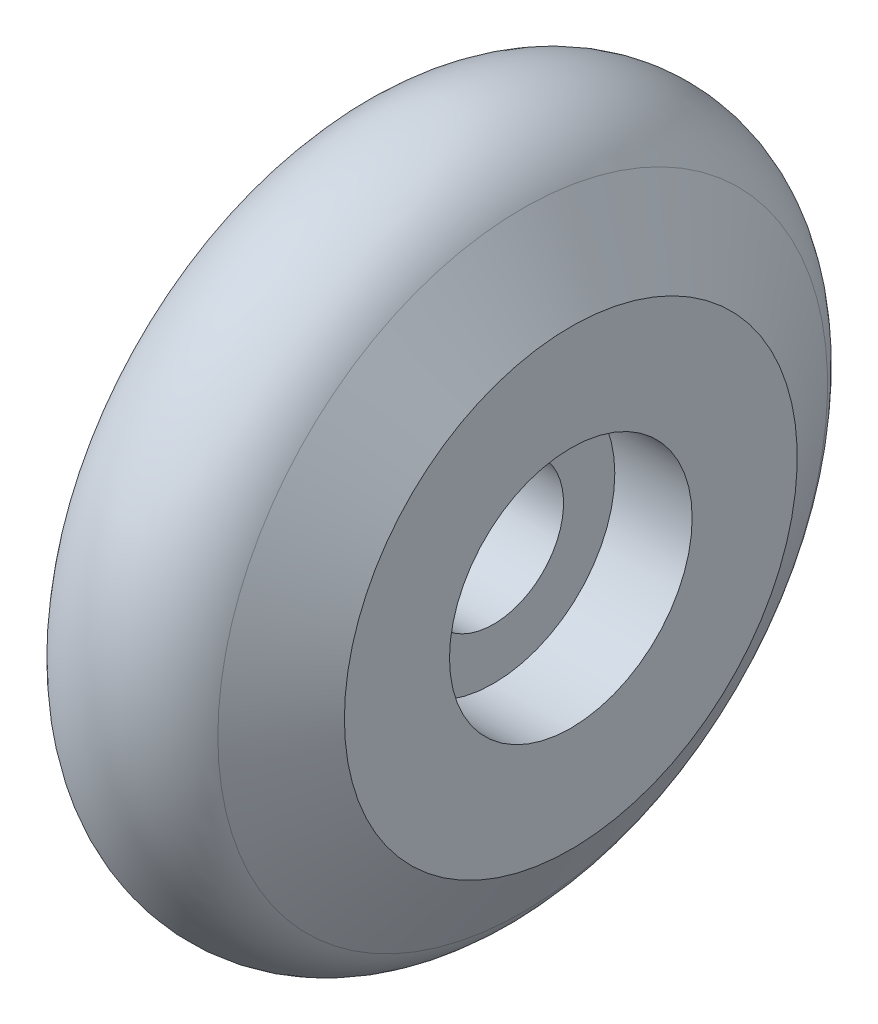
ISO-10303-21;
HEADER;
FILE_DESCRIPTION(('STEP AP214'),'2;1');
FILE_NAME('part.step','',(''),(''),'','','');
FILE_SCHEMA(('AUTOMOTIVE_DESIGN { 1 0 10303 214 1 1 1 1 }'));
ENDSEC;
DATA;
#1=APPLICATION_CONTEXT('core data for automotive mechanical design processes');
#2=APPLICATION_PROTOCOL_DEFINITION('international standard','automotive_design',2000,#1);
#3=PRODUCT_CONTEXT('',#1,'mechanical');
#4=PRODUCT('Part','Part','',(#3));
#5=PRODUCT_RELATED_PRODUCT_CATEGORY('part','',(#4));
#6=PRODUCT_DEFINITION_FORMATION('','',#4);
#7=PRODUCT_DEFINITION_CONTEXT('part definition',#1,'design');
#8=PRODUCT_DEFINITION('design','',#6,#7);
#9=PRODUCT_DEFINITION_SHAPE('','',#8);
#10=(LENGTH_UNIT() NAMED_UNIT(*) SI_UNIT(.MILLI.,.METRE.));
#11=(NAMED_UNIT(*) PLANE_ANGLE_UNIT() SI_UNIT($,.RADIAN.));
#12=(NAMED_UNIT(*) SI_UNIT($,.STERADIAN.) SOLID_ANGLE_UNIT());
#13=UNCERTAINTY_MEASURE_WITH_UNIT(LENGTH_MEASURE(1.E-05),#10,'distance_accuracy_value','');
#14=(GEOMETRIC_REPRESENTATION_CONTEXT(3) GLOBAL_UNCERTAINTY_ASSIGNED_CONTEXT((#13)) GLOBAL_UNIT_ASSIGNED_CONTEXT((#10,
#11,#12)) REPRESENTATION_CONTEXT('',''));
#15=CARTESIAN_POINT('',(0.,0.,0.));
#16=DIRECTION('',(0.,0.,1.));
#17=DIRECTION('',(1.,0.,0.));
#18=AXIS2_PLACEMENT_3D('',#15,#16,#17);
#19=CARTESIAN_POINT('',(-4.9276,10.9982,0.));
#20=DIRECTION('',(1.,0.,0.));
#21=DIRECTION('',(0.,0.,-1.));
#22=AXIS2_PLACEMENT_3D('',#19,#20,#21);
#23=PLANE('',#22);
#24=CARTESIAN_POINT('',(-4.9276,0.,0.));
#25=DIRECTION('',(-1.,0.,0.));
#26=DIRECTION('',(0.,0.,1.));
#27=AXIS2_PLACEMENT_3D('',#24,#25,#26);
#28=CIRCLE('',#27,6.35);
#29=CARTESIAN_POINT('',(-4.9276,0.,6.35));
#30=VERTEX_POINT('',#29);
#31=EDGE_CURVE('E10',#30,#30,#28,.T.);
#32=ORIENTED_EDGE('',*,*,#31,.F.);
#33=EDGE_LOOP('',(#32));
#34=FACE_BOUND('',#33,.T.);
#35=CARTESIAN_POINT('',(-4.9276,0.,0.));
#36=DIRECTION('',(-1.,0.,0.));
#37=DIRECTION('',(0.,0.,1.));
#38=AXIS2_PLACEMENT_3D('',#35,#36,#37);
#39=CIRCLE('',#38,10.9982);
#40=CARTESIAN_POINT('',(-4.9276,0.,10.9982));
#41=VERTEX_POINT('',#40);
#42=EDGE_CURVE('E64',#41,#41,#39,.T.);
#43=ORIENTED_EDGE('',*,*,#42,.T.);
#44=EDGE_LOOP('',(#43));
#45=FACE_BOUND('',#44,.T.);
#46=ADVANCED_FACE('F30',(#34,#45),#23,.F.);
#47=CARTESIAN_POINT('',(0.,0.,0.));
#48=DIRECTION('',(-1.,0.,0.));
#49=DIRECTION('',(0.,0.,1.));
#50=AXIS2_PLACEMENT_3D('',#47,#48,#49);
#51=CYLINDRICAL_SURFACE('',#50,6.35);
#52=CARTESIAN_POINT('',(4.9276,0.,0.));
#53=DIRECTION('',(-1.,0.,0.));
#54=DIRECTION('',(0.,0.,1.));
#55=AXIS2_PLACEMENT_3D('',#52,#53,#54);
#56=CIRCLE('',#55,6.35);
#57=CARTESIAN_POINT('',(4.9276,0.,6.35));
#58=VERTEX_POINT('',#57);
#59=EDGE_CURVE('E36',#58,#58,#56,.T.);
#60=ORIENTED_EDGE('',*,*,#59,.F.);
#61=EDGE_LOOP('',(#60));
#62=FACE_BOUND('',#61,.T.);
#63=ORIENTED_EDGE('',*,*,#31,.T.);
#64=EDGE_LOOP('',(#63));
#65=FACE_BOUND('',#64,.T.);
#66=ADVANCED_FACE('F113',(#62,#65),#51,.F.);
#67=CARTESIAN_POINT('',(4.9276,6.35,0.));
#68=DIRECTION('',(-1.,0.,0.));
#69=DIRECTION('',(0.,0.,1.));
#70=AXIS2_PLACEMENT_3D('',#67,#68,#69);
#71=PLANE('',#70);
#72=CARTESIAN_POINT('',(4.9276,0.,0.));
#73=DIRECTION('',(-1.,0.,0.));
#74=DIRECTION('',(0.,0.,1.));
#75=AXIS2_PLACEMENT_3D('',#72,#73,#74);
#76=CIRCLE('',#75,10.9982);
#77=CARTESIAN_POINT('',(4.9276,0.,10.9982));
#78=VERTEX_POINT('',#77);
#79=EDGE_CURVE('E40',#78,#78,#76,.T.);
#80=ORIENTED_EDGE('',*,*,#79,.F.);
#81=EDGE_LOOP('',(#80));
#82=FACE_BOUND('',#81,.T.);
#83=ORIENTED_EDGE('',*,*,#59,.T.);
#84=EDGE_LOOP('',(#83));
#85=FACE_BOUND('',#84,.T.);
#86=ADVANCED_FACE('F108',(#82,#85),#71,.F.);
#87=CARTESIAN_POINT('',(0.,0.,0.));
#88=DIRECTION('',(-1.,0.,0.));
#89=DIRECTION('',(0.,0.,1.));
#90=AXIS2_PLACEMENT_3D('',#87,#88,#89);
#91=CYLINDRICAL_SURFACE('',#90,10.9982);
#92=CARTESIAN_POINT('',(11.938,0.,0.));
#93=DIRECTION('',(-1.,0.,0.));
#94=DIRECTION('',(0.,0.,1.));
#95=AXIS2_PLACEMENT_3D('',#92,#93,#94);
#96=CIRCLE('',#95,10.9982);
#97=CARTESIAN_POINT('',(11.938,0.,10.9982));
#98=VERTEX_POINT('',#97);
#99=EDGE_CURVE('E44',#98,#98,#96,.T.);
#100=ORIENTED_EDGE('',*,*,#99,.F.);
#101=EDGE_LOOP('',(#100));
#102=FACE_BOUND('',#101,.T.);
#103=ORIENTED_EDGE('',*,*,#79,.T.);
#104=EDGE_LOOP('',(#103));
#105=FACE_BOUND('',#104,.T.);
#106=ADVANCED_FACE('F102',(#102,#105),#91,.F.);
#107=CARTESIAN_POINT('',(11.938,10.9982,0.));
#108=DIRECTION('',(-1.,0.,0.));
#109=DIRECTION('',(0.,0.,1.));
#110=AXIS2_PLACEMENT_3D('',#107,#108,#109);
#111=PLANE('',#110);
#112=CARTESIAN_POINT('',(11.938,0.,0.));
#113=DIRECTION('',(-1.,0.,0.));
#114=DIRECTION('',(0.,0.,1.));
#115=AXIS2_PLACEMENT_3D('',#112,#113,#114);
#116=CIRCLE('',#115,20.5232);
#117=CARTESIAN_POINT('',(11.938,0.,20.5232));
#118=VERTEX_POINT('',#117);
#119=EDGE_CURVE('E49',#118,#118,#116,.T.);
#120=ORIENTED_EDGE('',*,*,#119,.F.);
#121=EDGE_LOOP('',(#120));
#122=FACE_BOUND('',#121,.T.);
#123=ORIENTED_EDGE('',*,*,#99,.T.);
#124=EDGE_LOOP('',(#123));
#125=FACE_BOUND('',#124,.T.);
#126=ADVANCED_FACE('F96',(#122,#125),#111,.F.);
#127=CARTESIAN_POINT('',(11.938,0.,0.));
#128=DIRECTION('',(-1.,0.,0.));
#129=DIRECTION('',(0.,0.,1.));
#130=AXIS2_PLACEMENT_3D('',#127,#128,#129);
#131=CONICAL_SURFACE('',#130,20.5232,1.02083937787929);
#132=CARTESIAN_POINT('',(7.57914303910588,0.,0.));
#133=DIRECTION('',(-1.,0.,0.));
#134=DIRECTION('',(0.,0.,1.));
#135=AXIS2_PLACEMENT_3D('',#132,#133,#134);
#136=CIRCLE('',#135,27.6333631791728);
#137=CARTESIAN_POINT('',(7.57914303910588,0.,27.6333631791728));
#138=VERTEX_POINT('',#137);
#139=EDGE_CURVE('E52',#138,#138,#136,.T.);
#140=ORIENTED_EDGE('',*,*,#139,.F.);
#141=EDGE_LOOP('',(#140));
#142=FACE_BOUND('',#141,.T.);
#143=ORIENTED_EDGE('',*,*,#119,.T.);
#144=EDGE_LOOP('',(#143));
#145=FACE_BOUND('',#144,.T.);
#146=ADVANCED_FACE('F90',(#142,#145),#131,.T.);
#147=CARTESIAN_POINT('',(0.,0.,0.));
#148=DIRECTION('',(-1.,0.,0.));
#149=DIRECTION('',(0.,0.,1.));
#150=AXIS2_PLACEMENT_3D('',#147,#148,#149);
#151=TOROIDAL_SURFACE('',#150,22.987,8.89);
#152=CARTESIAN_POINT('',(-7.57914303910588,0.,0.));
#153=DIRECTION('',(-1.,0.,0.));
#154=DIRECTION('',(0.,0.,1.));
#155=AXIS2_PLACEMENT_3D('',#152,#153,#154);
#156=CIRCLE('',#155,27.6333631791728);
#157=CARTESIAN_POINT('',(-7.57914303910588,0.,27.6333631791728));
#158=VERTEX_POINT('',#157);
#159=EDGE_CURVE('E55',#158,#158,#156,.T.);
#160=ORIENTED_EDGE('',*,*,#159,.F.);
#161=EDGE_LOOP('',(#160));
#162=FACE_BOUND('',#161,.T.);
#163=ORIENTED_EDGE('',*,*,#139,.T.);
#164=EDGE_LOOP('',(#163));
#165=FACE_BOUND('',#164,.T.);
#166=ADVANCED_FACE('F84',(#162,#165),#151,.T.);
#167=CARTESIAN_POINT('',(-7.57914303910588,0.,0.));
#168=DIRECTION('',(1.,0.,0.));
#169=DIRECTION('',(0.,0.,-1.));
#170=AXIS2_PLACEMENT_3D('',#167,#168,#169);
#171=CONICAL_SURFACE('',#170,27.6333631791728,1.02083937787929);
#172=CARTESIAN_POINT('',(-11.938,0.,0.));
#173=DIRECTION('',(-1.,0.,0.));
#174=DIRECTION('',(0.,0.,1.));
#175=AXIS2_PLACEMENT_3D('',#172,#173,#174);
#176=CIRCLE('',#175,20.5232);
#177=CARTESIAN_POINT('',(-11.938,0.,20.5232));
#178=VERTEX_POINT('',#177);
#179=EDGE_CURVE('E58',#178,#178,#176,.T.);
#180=ORIENTED_EDGE('',*,*,#179,.F.);
#181=EDGE_LOOP('',(#180));
#182=FACE_BOUND('',#181,.T.);
#183=ORIENTED_EDGE('',*,*,#159,.T.);
#184=EDGE_LOOP('',(#183));
#185=FACE_BOUND('',#184,.T.);
#186=ADVANCED_FACE('F78',(#182,#185),#171,.T.);
#187=CARTESIAN_POINT('',(-11.938,20.5232,0.));
#188=DIRECTION('',(1.,0.,0.));
#189=DIRECTION('',(0.,0.,-1.));
#190=AXIS2_PLACEMENT_3D('',#187,#188,#189);
#191=PLANE('',#190);
#192=CARTESIAN_POINT('',(-11.938,0.,0.));
#193=DIRECTION('',(-1.,0.,0.));
#194=DIRECTION('',(0.,0.,1.));
#195=AXIS2_PLACEMENT_3D('',#192,#193,#194);
#196=CIRCLE('',#195,10.9982);
#197=CARTESIAN_POINT('',(-11.938,0.,10.9982));
#198=VERTEX_POINT('',#197);
#199=EDGE_CURVE('E61',#198,#198,#196,.T.);
#200=ORIENTED_EDGE('',*,*,#199,.F.);
#201=EDGE_LOOP('',(#200));
#202=FACE_BOUND('',#201,.T.);
#203=ORIENTED_EDGE('',*,*,#179,.T.);
#204=EDGE_LOOP('',(#203));
#205=FACE_BOUND('',#204,.T.);
#206=ADVANCED_FACE('F72',(#202,#205),#191,.F.);
#207=CARTESIAN_POINT('',(0.,0.,0.));
#208=DIRECTION('',(-1.,0.,0.));
#209=DIRECTION('',(0.,0.,1.));
#210=AXIS2_PLACEMENT_3D('',#207,#208,#209);
#211=CYLINDRICAL_SURFACE('',#210,10.9982);
#212=ORIENTED_EDGE('',*,*,#42,.F.);
#213=EDGE_LOOP('',(#212));
#214=FACE_BOUND('',#213,.T.);
#215=ORIENTED_EDGE('',*,*,#199,.T.);
#216=EDGE_LOOP('',(#215));
#217=FACE_BOUND('',#216,.T.);
#218=ADVANCED_FACE('F69',(#214,#217),#211,.F.);
#219=CLOSED_SHELL('',(#46,#66,#86,#106,#126,#146,#166,#186,#206,#218));
#220=MANIFOLD_SOLID_BREP('B2',#219);
#221=ADVANCED_BREP_SHAPE_REPRESENTATION('',(#18,#220),#14);
#222=SHAPE_DEFINITION_REPRESENTATION(#9,#221);
ENDSEC;
END-ISO-10303-21;
